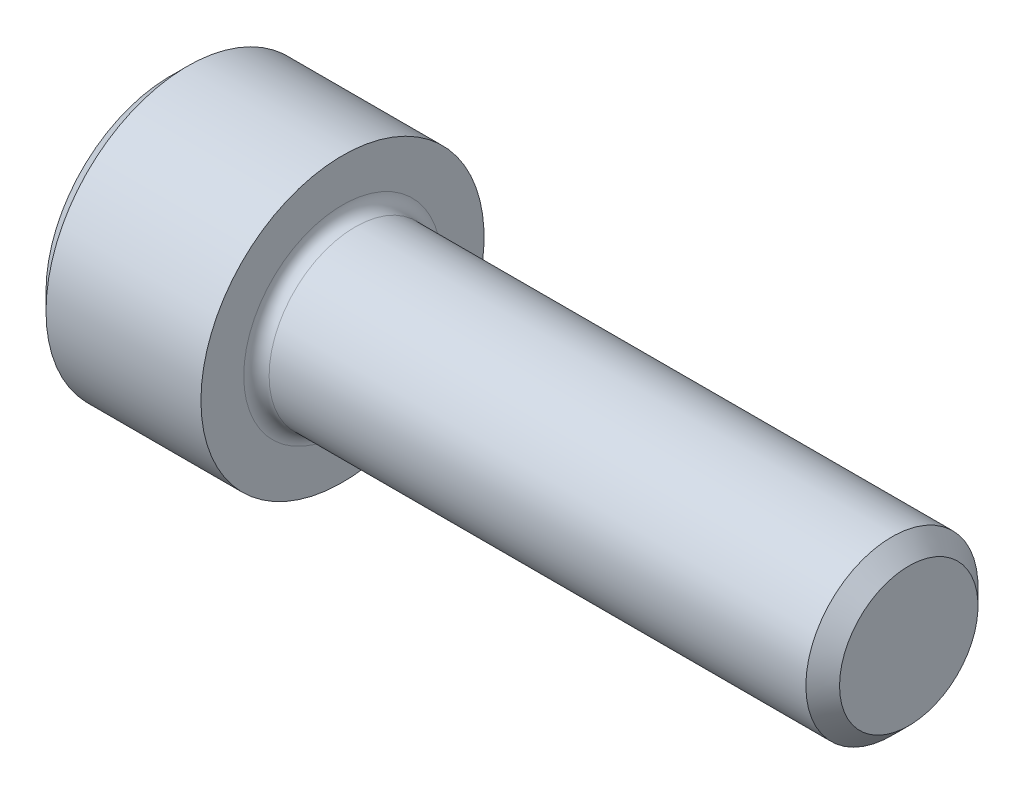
from build123d import *

# Parameters (mm, degrees)
FILLET1_R   = 0.3556
HEX_2_DEPTH = 2.286


with BuildPart() as part:
    # BodySke → Base-Revolve (revolve)
    with BuildSketch(Plane.XY, mode=Mode.PRIVATE) as base_revolve_sk:
        Polygon((0, 0), (0, 3.48615), (0.4826, 3.96875), (4.826, 3.96875), (4.826, 2.413), (20.22856, 2.413), (20.701, 1.94056), (20.701, 0), align=None)
    revolve(base_revolve_sk.sketch.rotate(Axis((-31.75, 0, 0), (1, 0, 0)), 90), axis=Axis((-31.75, 0, 0), (1, 0, 0)))

    # Fillet1
    fillet1_edges = [part.edges().sort_by_distance(p)[0] for p in [
        (4.826, 0, -2.413),
    ]]
    fillet(fillet1_edges, radius=FILLET1_R)

    # Sketch2 → Hex-PreBroach (revolve, cut)
    with BuildSketch(Plane.XY, mode=Mode.PRIVATE) as hex_prebroach_sk:
        Polygon((0, 1.98501), (2.286, 1.98501), (3.432046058, 0), (0, 0), align=None)
    revolve(hex_prebroach_sk.sketch.rotate(Axis((0, 0, 0), (1, 0, 0)), 90), axis=Axis((0, 0, 0), (1, 0, 0)), mode=Mode.SUBTRACT)

    # Sketch3 → Hex 2 (cut)
    with BuildSketch(Plane(origin=(0, 0, 0), x_dir=(0, 0.500000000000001, 0.866025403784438), z_dir=(-1, 0, 0))):
        Polygon((1.146046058, 1.98501), (-1.146046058, 1.98501), (-2.292092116, 0), (-1.146046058, -1.98501), (1.146046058, -1.98501), (2.292092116, 0), align=None)
    extrude(amount=-HEX_2_DEPTH, mode=Mode.SUBTRACT)


solid = part.part
